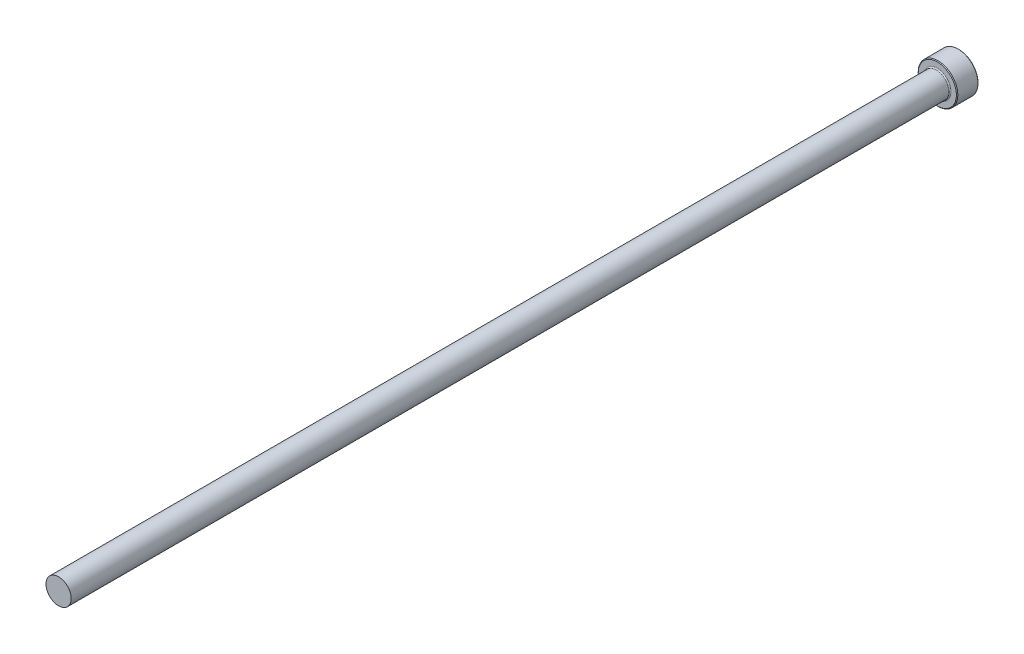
from build123d import *

# Parameters (mm, degrees)
CHAMFER1_SIZE = 0.2


with BuildPart() as part:
    # Sketch1 → Revolve1 (revolve)
    with BuildSketch(Plane(origin=(0, 0, 0), x_dir=(0, 0, -1), z_dir=(1, 0, 0)), mode=Mode.PRIVATE) as revolve1_sk:
        with BuildLine():
            Line((0, 0), (0, 5.5))
            Line((0, 5.5), (-6, 5.5))
            Line((-6, 5.5), (-6, 3.8))
            ThreePointArc((-6, 3.8), (-6.087867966, 3.587867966), (-6.3, 3.5))
            Line((-6.3, 3.5), (-250, 3.5))
            Line((-250, 3.5), (-250, 0))
            Line((-250, 0), (0, 0))
        make_face()
    revolve(revolve1_sk.sketch.rotate(Axis((0, 0, 109.05062828), (0, 0, -1)), 90), axis=Axis((0, 0, 109.05062828), (0, 0, -1)))

    # Chamfer1
    chamfer1_edges = [part.edges().sort_by_distance(p)[0] for p in [
        (-5.5, 0, 0),
        (-5.5, 0, 6),
    ]]
    chamfer(chamfer1_edges, length=CHAMFER1_SIZE)


solid = part.part
